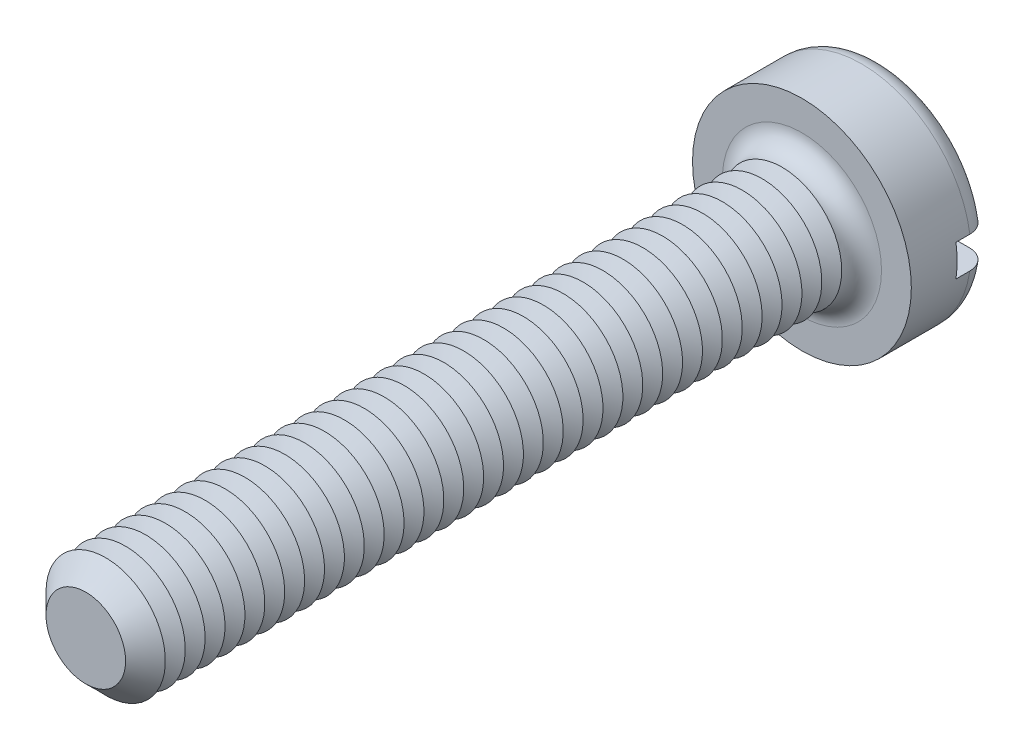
from build123d import *

# Parameters (mm, degrees)
SKETCH3_R           = 2.75
BOSS_EXTRUDE2_DEPTH = 2
SKETCH4_R           = 1.5
BOSS_EXTRUDE3_DEPTH = 18
FILLET1_R           = 0.5
CHAMFER1_SIZE       = 0.5
LPATTERN1_COUNT     = 34
LPATTERN1_PITCH     = 0.5
SKETCH8_W           = 5.5
SKETCH8_H           = 0.8
CUT_EXTRUDE1_DEPTH  = 0.85


with BuildPart() as part:
    # Sketch3 → Boss-Extrude2 (new body)
    with BuildSketch(Plane.XY):
        Circle(SKETCH3_R)
    extrude(amount=-BOSS_EXTRUDE2_DEPTH)

    # Sketch4 → Boss-Extrude3 (add)
    with BuildSketch(Plane.XY):
        Circle(SKETCH4_R)
    extrude(amount=BOSS_EXTRUDE3_DEPTH)

    # Fillet1
    fillet1_edges = [part.edges().sort_by_distance(p)[0] for p in [
        (-2.75, 0, -2),
        (-1.5, 0, 0),
    ]]
    fillet(fillet1_edges, radius=FILLET1_R)

    # Chamfer1
    chamfer1_edges = [part.edges().sort_by_distance(p)[0] for p in [
        (-1.5, 0, 18),
    ]]
    chamfer(chamfer1_edges, length=CHAMFER1_SIZE)

    # Sketch6 → Cut-Revolve1 (revolve, cut)
    with BuildSketch(Plane(origin=(0, 0, 0), x_dir=(0, 0, -1), z_dir=(1, 0, 0)), mode=Mode.PRIVATE) as cut_revolve1_sk:
        Polygon((-0.5, 1.5), (-0.75, 1.066987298), (-1, 1.5), align=None)
    cut_revolve1 = revolve(cut_revolve1_sk.sketch.rotate(Axis((0, 0, -1.694361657), (0, 0, 1)), 90), axis=Axis((0, 0, -1.694361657), (0, 0, 1)), mode=Mode.SUBTRACT)

    # LPattern1: Cut-Revolve1 ×34
    with Locations(*[(0, 0, i * LPATTERN1_PITCH) for i in range(1, LPATTERN1_COUNT)]):
        add(cut_revolve1, mode=Mode.SUBTRACT)

    # Sketch8 → Cut-Extrude1 (cut)
    with BuildSketch(Plane(origin=(0, 0, -2), x_dir=(-1, 0, 0), z_dir=(0, 0, -1))):
        Rectangle(SKETCH8_W, SKETCH8_H)
    extrude(amount=-CUT_EXTRUDE1_DEPTH, mode=Mode.SUBTRACT)


solid = part.part
